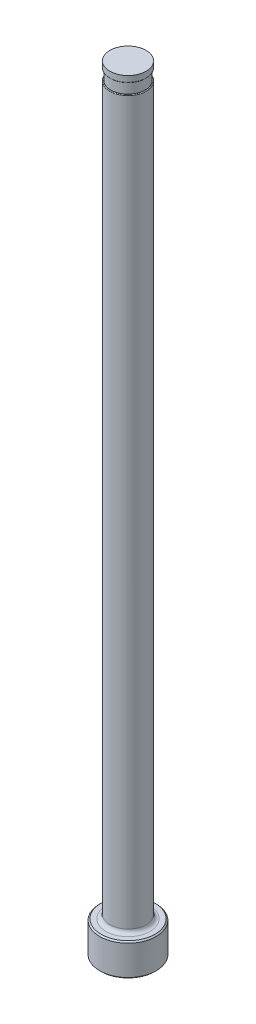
from build123d import *

# Parameters (mm, degrees)
CHAMFER1_SIZE     = 0.254
FILLET1_R         = 0.762
SKETCH2_W         = 0.2032
SKETCH2_H         = 2.032
D_SLOT_DEPTH      = 153.60197502
D_SLOT_DEPTH_BACK = 153.60197502
SKETCH5_W         = 0.0127
SKETCH5_H         = 1.27
FILLET2_R         = 0.127


with BuildPart() as part:
    # Sketch1 → Revolve1 (revolve)
    with BuildSketch(Plane.XY, mode=Mode.PRIVATE) as revolve1_sk:
        Polygon((0, 0), (-5.5499, 0), (-5.5499, 6.35), (-3.57124, 6.35), (-3.57124, 152.4), (0, 152.4), align=None)
    revolve(revolve1_sk.sketch.rotate(Axis((0, 259.958771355, 0), (0, -1, 0)), 270), axis=Axis((0, 259.958771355, 0), (0, -1, 0)))

    # Chamfer1
    chamfer1_edges = [part.edges().sort_by_distance(p)[0] for p in [
        (0, 6.35, -5.5499),
        (0, 0, -5.5499),
    ]]
    chamfer(chamfer1_edges, length=CHAMFER1_SIZE)

    # Fillet1
    fillet1_edges = [part.edges().sort_by_distance(p)[0] for p in [
        (0, 6.35, -3.57124),
    ]]
    fillet(fillet1_edges, radius=FILLET1_R)

    # Sketch2 → Vent Relief (revolve, cut)
    with BuildSketch(Plane.XY, mode=Mode.PRIVATE) as vent_relief_sk:
        with Locations((-3.46964, 150.114)):
            Rectangle(SKETCH2_W, SKETCH2_H)
    revolve(vent_relief_sk.sketch.rotate(Axis((0, 153.448281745, 0), (0, -1, 0)), 270), axis=Axis((0, 153.448281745, 0), (0, -1, 0)), mode=Mode.SUBTRACT)

    # Sketch3 → D-Slot (cut, two sides: drawn at the far end of the back side and taken through both)
    with BuildSketch(Plane.XY.offset(-D_SLOT_DEPTH_BACK)):
        with BuildLine():
            Line((-3.36804, 150.114), (-3.36804, 86.614))
            ThreePointArc((-3.36804, 86.614), (-3.419253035, 86.046038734), (-3.57124, 85.4964))
            Line((-3.57124, 85.4964), (-3.57124, 150.114))
            Line((-3.57124, 150.114), (-3.36804, 150.114))
        make_face()
    extrude(amount=D_SLOT_DEPTH + D_SLOT_DEPTH_BACK, mode=Mode.SUBTRACT)

    # Sketch5 → Vent Diameter (revolve, cut)
    with BuildSketch(Plane.XY, mode=Mode.PRIVATE) as vent_diameter_sk:
        with Locations((-3.56489, 151.765)):
            Rectangle(SKETCH5_W, SKETCH5_H)
    revolve(vent_diameter_sk.sketch.rotate(Axis((0, 152.687735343, 0), (0, -1, 0)), 90), axis=Axis((0, 152.687735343, 0), (0, -1, 0)), mode=Mode.SUBTRACT)

    # Fillet2
    fillet2_edges = [part.edges().sort_by_distance(p)[0] for p in [
        (2.915000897, 149.098, -2.063134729),
        (0, 151.13, 3.55854),
    ]]
    fillet(fillet2_edges, radius=FILLET2_R)


solid = part.part
